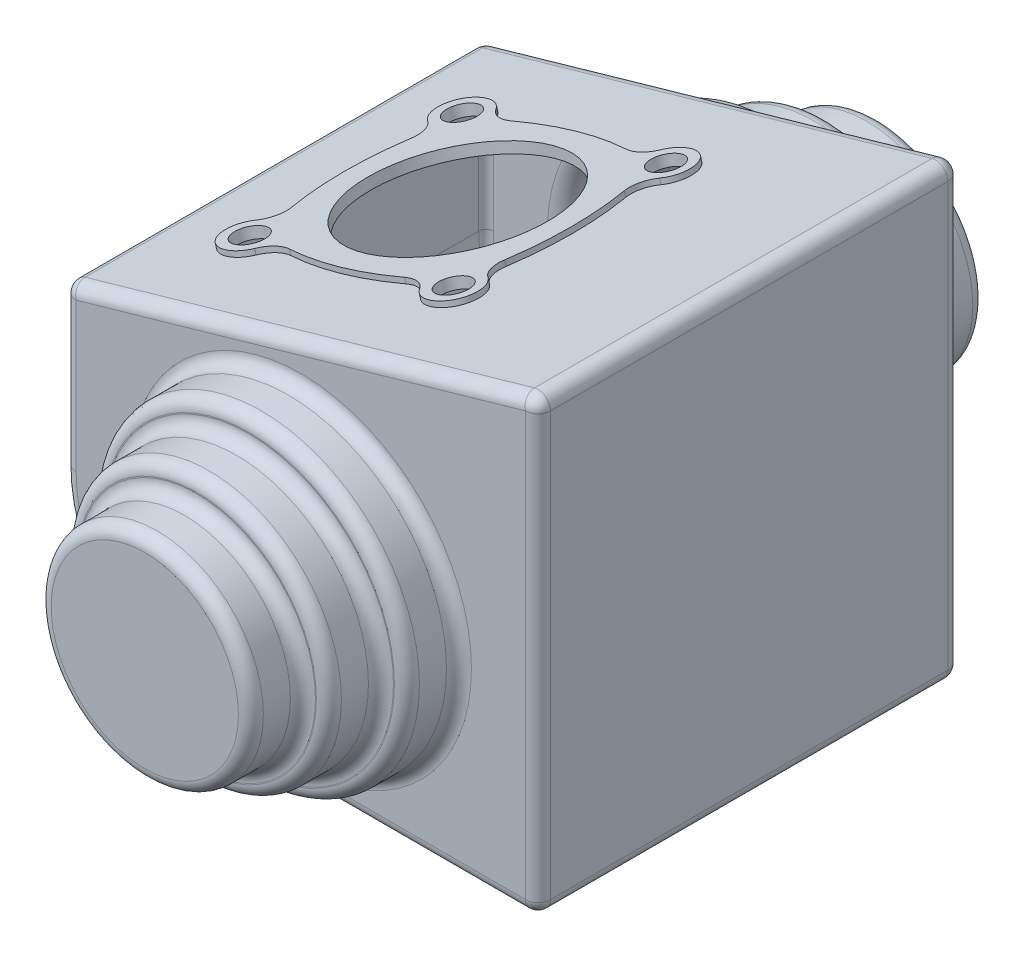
from build123d import *

# Parameters (mm, degrees)
BOSS_EXTRUDE1_DEPTH = 101.5
SKETCH4_R           = 76
BOSS_EXTRUDE3_DEPTH = 25
SKETCH4_4_R         = 63.5
BOSS_EXTRUDE4_DEPTH = 50
SKETCH4_5_R         = 51
BOSS_EXTRUDE5_DEPTH = 75
FILLET7_R           = 6
SHELL1_T            = 2.5
SKETCH5_R           = 45
SKETCH5_R_2         = 7.5
CUT_EXTRUDE1_DEPTH  = 10
BOSS_EXTRUDE6_START = 2.5
SKETCH5_4_R         = 45
SKETCH5_4_R_2       = 7.5
BOSS_EXTRUDE6_DEPTH = 2.5


with BuildPart() as part:
    # Sketch3 → Boss-Extrude1 (new, symmetric)
    with BuildSketch(Plane.XY):
        with BuildLine():
            Line((-38, -89), (114, -89))
            Line((114, -89), (114, 128.377947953))
            Line((114, 128.377947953), (-114, 63))
            Line((-114, 63), (-114, -13))
            ThreePointArc((-114, -13), (-91.74011537, -66.74011537), (-38, -89))
        make_face()
    extrude(amount=BOSS_EXTRUDE1_DEPTH, both=True)

    # Sketch4 → Boss-Extrude3 (add)
    with BuildSketch(Plane.XY.offset(101.5)):
        Circle(SKETCH4_R)
    boss_extrude3 = extrude(amount=BOSS_EXTRUDE3_DEPTH)

    # Sketch4_4 → Boss-Extrude4 (add)
    with BuildSketch(Plane.XY.offset(101.5)):
        Circle(SKETCH4_4_R)
    boss_extrude4 = extrude(amount=BOSS_EXTRUDE4_DEPTH)

    # Sketch4_5 → Boss-Extrude5 (add)
    with BuildSketch(Plane.XY.offset(101.5)):
        Circle(SKETCH4_5_R)
    boss_extrude5 = extrude(amount=BOSS_EXTRUDE5_DEPTH)

    # Mirror1: Boss-Extrude3, Boss-Extrude4, Boss-Extrude5 across plane
    add(boss_extrude3.mirror(Plane.XY))
    add(boss_extrude4.mirror(Plane.XY))
    add(boss_extrude5.mirror(Plane.XY))

    # Fillet7
    fillet7_edges = [part.edges().sort_by_distance(p)[0] for p in [
        (114, 19.688973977, 101.5),
        (-76, 0, 101.5),
        (0, 95.688973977, 101.5),
        (-76, 0, 126.5),
        (-114, 25, 101.5),
        (-63.5, 0, 126.5),
        (-63.5, 0, 151.5),
        (-51, 0, 151.5),
        (-51, 0, 176.5),
        (-76, 0, -126.5),
        (-76, 0, -101.5),
        (-63.5, 0, -126.5),
        (-63.5, 0, -151.5),
        (-51, 0, -151.5),
        (-51, 0, -176.5),
        (-91.74011537, -66.74011537, 101.5),
        (-114, 25, -101.5),
        (0, 95.688973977, -101.5),
        (114, 19.688973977, -101.5),
        (38, -89, -101.5),
        (-91.74011537, -66.74011537, -101.5),
        (38, -89, 101.5),
        (-114, 63, 0),
        (114, 128.377947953, 0),
        (114, -89, 0),
    ]]
    fillet(fillet7_edges, radius=FILLET7_R)

    # Shell1 (no face opened: a closed hollow body)
    add(offset(amount=-SHELL1_T, mode=Mode.PRIVATE), mode=Mode.SUBTRACT)

    # Sketch5 → Cut-Extrude1 (cut)
    with BuildSketch(Plane(origin=(-25.353715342, 88.41891309, 0), x_dir=(0.9612616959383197, 0.2756373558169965, 0), z_dir=(-0.27563735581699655, 0.9612616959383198, 0))):
        with Locations(Location((0, 0, 0), (0, 0, 180))):
            Circle(SKETCH5_R)
        with Locations(Location((-51, 51, 0), (0, 0, 180))):
            Circle(SKETCH5_R_2)
        with Locations(Location((51, 51, 0), (0, 0, 180))):
            Circle(SKETCH5_R_2)
        with Locations(Location((51, -51, 0), (0, 0, 180))):
            Circle(SKETCH5_R_2)
        with Locations(Location((-51, -51, 0), (0, 0, 180))):
            Circle(SKETCH5_R_2)
    extrude(amount=-CUT_EXTRUDE1_DEPTH, mode=Mode.SUBTRACT)

    # Sketch5_4 → Boss-Extrude6 (add)
    with BuildSketch(Plane(origin=(-25.353715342, 88.41891309, 0), x_dir=(0.9612616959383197, 0.2756373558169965, 0), z_dir=(-0.27563735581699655, 0.9612616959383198, 0)).offset(BOSS_EXTRUDE6_START)):
        with BuildLine():
            ThreePointArc((57.99553429, 41.25), (59.485281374, 59.485281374), (41.25, 57.99553429))
            ThreePointArc((41.25, 57.99553429), (35.726297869, 53.759933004), (28.78057554, 53.303265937))
            ThreePointArc((28.78057554, 53.303265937), (0, 56.60735464), (-28.78057554, 53.303265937))
            ThreePointArc((-28.78057554, 53.303265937), (-35.726297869, 53.759933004), (-41.25, 57.99553429))
            ThreePointArc((-41.25, 57.99553429), (-59.485281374, 59.485281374), (-57.99553429, 41.25))
            ThreePointArc((-57.99553429, 41.25), (-53.759933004, 35.726297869), (-53.303265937, 28.78057554))
            ThreePointArc((-53.303265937, 28.78057554), (-56.60735464, 0), (-53.303265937, -28.78057554))
            ThreePointArc((-53.303265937, -28.78057554), (-53.759933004, -35.726297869), (-57.99553429, -41.25))
            ThreePointArc((-57.99553429, -41.25), (-59.485281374, -59.485281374), (-41.25, -57.99553429))
            ThreePointArc((-41.25, -57.99553429), (-35.726297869, -53.759933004), (-28.78057554, -53.303265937))
            ThreePointArc((-28.78057554, -53.303265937), (0, -56.60735464), (28.78057554, -53.303265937))
            ThreePointArc((28.78057554, -53.303265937), (35.726297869, -53.759933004), (41.25, -57.99553429))
            ThreePointArc((41.25, -57.99553429), (59.485281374, -59.485281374), (57.99553429, -41.25))
            ThreePointArc((57.99553429, -41.25), (53.759933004, -35.726297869), (53.303265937, -28.78057554))
            ThreePointArc((53.303265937, -28.78057554), (56.60735464, 0), (53.303265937, 28.78057554))
            ThreePointArc((53.303265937, 28.78057554), (53.759933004, 35.726297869), (57.99553429, 41.25))
        make_face()
        with Locations(Location((0, 0, 0), (0, 0, 180))):
            Circle(SKETCH5_4_R, mode=Mode.SUBTRACT)
        with Locations(Location((-51, 51, 0), (0, 0, 180))):
            Circle(SKETCH5_4_R_2, mode=Mode.SUBTRACT)
        with Locations(Location((51, 51, 0), (0, 0, 180))):
            Circle(SKETCH5_4_R_2, mode=Mode.SUBTRACT)
        with Locations(Location((51, -51, 0), (0, 0, 180))):
            Circle(SKETCH5_4_R_2, mode=Mode.SUBTRACT)
        with Locations(Location((-51, -51, 0), (0, 0, 180))):
            Circle(SKETCH5_4_R_2, mode=Mode.SUBTRACT)
    extrude(amount=-BOSS_EXTRUDE6_DEPTH)


solid = part.part
